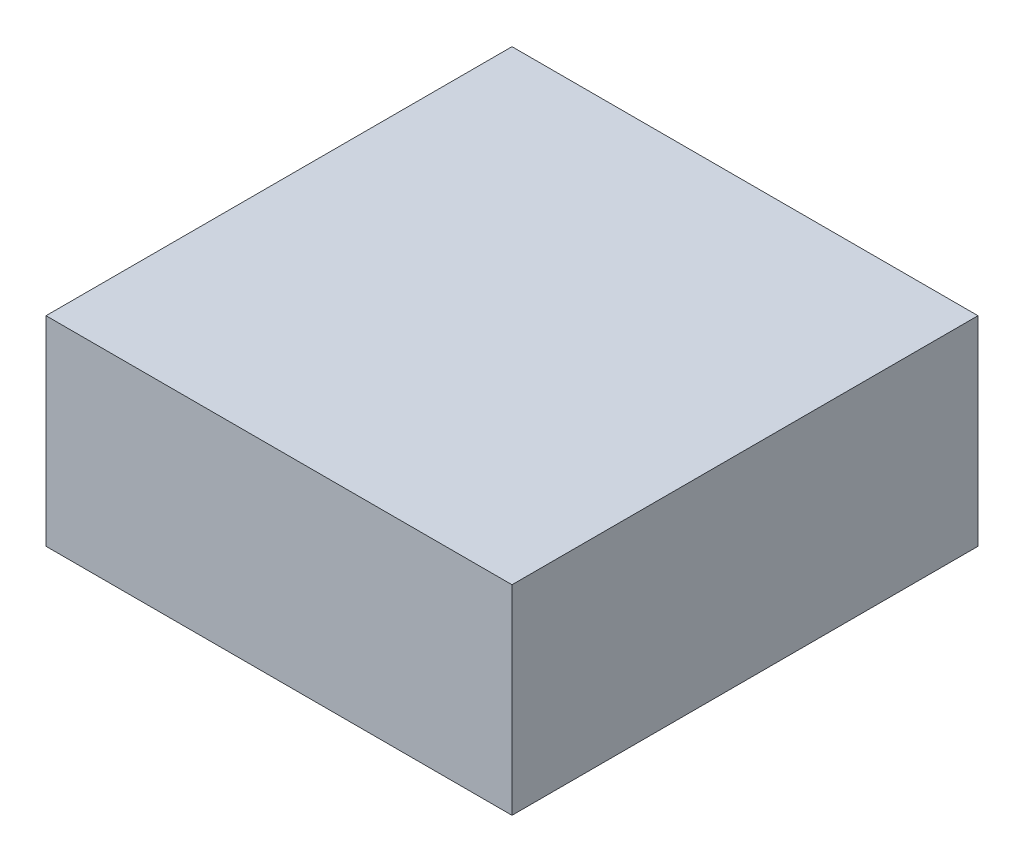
ISO-10303-21;
HEADER;
FILE_DESCRIPTION(('STEP AP214'),'2;1');
FILE_NAME('part.step','',(''),(''),'','','');
FILE_SCHEMA(('AUTOMOTIVE_DESIGN { 1 0 10303 214 1 1 1 1 }'));
ENDSEC;
DATA;
#1=APPLICATION_CONTEXT('core data for automotive mechanical design processes');
#2=APPLICATION_PROTOCOL_DEFINITION('international standard','automotive_design',2000,#1);
#3=PRODUCT_CONTEXT('',#1,'mechanical');
#4=PRODUCT('Part','Part','',(#3));
#5=PRODUCT_RELATED_PRODUCT_CATEGORY('part','',(#4));
#6=PRODUCT_DEFINITION_FORMATION('','',#4);
#7=PRODUCT_DEFINITION_CONTEXT('part definition',#1,'design');
#8=PRODUCT_DEFINITION('design','',#6,#7);
#9=PRODUCT_DEFINITION_SHAPE('','',#8);
#10=(LENGTH_UNIT() NAMED_UNIT(*) SI_UNIT(.MILLI.,.METRE.));
#11=(NAMED_UNIT(*) PLANE_ANGLE_UNIT() SI_UNIT($,.RADIAN.));
#12=(NAMED_UNIT(*) SI_UNIT($,.STERADIAN.) SOLID_ANGLE_UNIT());
#13=UNCERTAINTY_MEASURE_WITH_UNIT(LENGTH_MEASURE(1.E-05),#10,'distance_accuracy_value','');
#14=(GEOMETRIC_REPRESENTATION_CONTEXT(3) GLOBAL_UNCERTAINTY_ASSIGNED_CONTEXT((#13)) GLOBAL_UNIT_ASSIGNED_CONTEXT((#10,
#11,#12)) REPRESENTATION_CONTEXT('',''));
#15=CARTESIAN_POINT('',(0.,0.,0.));
#16=DIRECTION('',(0.,0.,1.));
#17=DIRECTION('',(1.,0.,0.));
#18=AXIS2_PLACEMENT_3D('',#15,#16,#17);
#19=CARTESIAN_POINT('',(17.5,15.,17.5));
#20=DIRECTION('',(-1.,0.,0.));
#21=DIRECTION('',(0.,0.,1.));
#22=AXIS2_PLACEMENT_3D('',#19,#20,#21);
#23=PLANE('',#22);
#24=DIRECTION('',(0.,0.,-1.));
#25=VECTOR('',#24,1.);
#26=CARTESIAN_POINT('',(17.5,0.,17.5));
#27=LINE('',#26,#25);
#28=CARTESIAN_POINT('',(17.5,0.,17.5));
#29=VERTEX_POINT('',#28);
#30=CARTESIAN_POINT('',(17.5,0.,-17.5));
#31=VERTEX_POINT('',#30);
#32=EDGE_CURVE('E575',#29,#31,#27,.T.);
#33=ORIENTED_EDGE('',*,*,#32,.T.);
#34=DIRECTION('',(0.,-1.,0.));
#35=VECTOR('',#34,1.);
#36=CARTESIAN_POINT('',(17.5,15.,-17.5));
#37=LINE('',#36,#35);
#38=CARTESIAN_POINT('',(17.5,15.,-17.5));
#39=VERTEX_POINT('',#38);
#40=EDGE_CURVE('E635',#39,#31,#37,.T.);
#41=ORIENTED_EDGE('',*,*,#40,.F.);
#42=DIRECTION('',(0.,0.,-1.));
#43=VECTOR('',#42,1.);
#44=CARTESIAN_POINT('',(17.5,15.,17.5));
#45=LINE('',#44,#43);
#46=CARTESIAN_POINT('',(17.5,15.,17.5));
#47=VERTEX_POINT('',#46);
#48=EDGE_CURVE('E577',#47,#39,#45,.T.);
#49=ORIENTED_EDGE('',*,*,#48,.F.);
#50=DIRECTION('',(0.,-1.,0.));
#51=VECTOR('',#50,1.);
#52=CARTESIAN_POINT('',(17.5,15.,17.5));
#53=LINE('',#52,#51);
#54=EDGE_CURVE('E565',#47,#29,#53,.T.);
#55=ORIENTED_EDGE('',*,*,#54,.T.);
#56=EDGE_LOOP('',(#33,#41,#49,#55));
#57=FACE_BOUND('',#56,.T.);
#58=ADVANCED_FACE('F36',(#57),#23,.F.);
#59=CARTESIAN_POINT('',(-17.5,15.,-17.5));
#60=DIRECTION('',(0.,0.,1.));
#61=DIRECTION('',(1.,0.,0.));
#62=AXIS2_PLACEMENT_3D('',#59,#60,#61);
#63=PLANE('',#62);
#64=DIRECTION('',(-1.,0.,0.));
#65=VECTOR('',#64,1.);
#66=CARTESIAN_POINT('',(-17.5,0.,-17.5));
#67=LINE('',#66,#65);
#68=CARTESIAN_POINT('',(-17.5,0.,-17.5));
#69=VERTEX_POINT('',#68);
#70=EDGE_CURVE('E578',#31,#69,#67,.T.);
#71=ORIENTED_EDGE('',*,*,#70,.T.);
#72=DIRECTION('',(0.,-1.,0.));
#73=VECTOR('',#72,1.);
#74=CARTESIAN_POINT('',(-17.5,15.,-17.5));
#75=LINE('',#74,#73);
#76=CARTESIAN_POINT('',(-17.5,15.,-17.5));
#77=VERTEX_POINT('',#76);
#78=EDGE_CURVE('E572',#77,#69,#75,.T.);
#79=ORIENTED_EDGE('',*,*,#78,.F.);
#80=DIRECTION('',(-1.,0.,0.));
#81=VECTOR('',#80,1.);
#82=CARTESIAN_POINT('',(-17.5,15.,-17.5));
#83=LINE('',#82,#81);
#84=EDGE_CURVE('E588',#39,#77,#83,.T.);
#85=ORIENTED_EDGE('',*,*,#84,.F.);
#86=ORIENTED_EDGE('',*,*,#40,.T.);
#87=EDGE_LOOP('',(#71,#79,#85,#86));
#88=FACE_BOUND('',#87,.T.);
#89=ADVANCED_FACE('F236',(#88),#63,.F.);
#90=CARTESIAN_POINT('',(-17.5,15.,17.5));
#91=DIRECTION('',(1.,0.,0.));
#92=DIRECTION('',(0.,0.,-1.));
#93=AXIS2_PLACEMENT_3D('',#90,#91,#92);
#94=PLANE('',#93);
#95=DIRECTION('',(0.,0.,1.));
#96=VECTOR('',#95,1.);
#97=CARTESIAN_POINT('',(-17.5,0.,17.5));
#98=LINE('',#97,#96);
#99=CARTESIAN_POINT('',(-17.5,0.,17.5));
#100=VERTEX_POINT('',#99);
#101=EDGE_CURVE('E634',#69,#100,#98,.T.);
#102=ORIENTED_EDGE('',*,*,#101,.T.);
#103=DIRECTION('',(0.,-1.,0.));
#104=VECTOR('',#103,1.);
#105=CARTESIAN_POINT('',(-17.5,15.,17.5));
#106=LINE('',#105,#104);
#107=CARTESIAN_POINT('',(-17.5,15.,17.5));
#108=VERTEX_POINT('',#107);
#109=EDGE_CURVE('E568',#108,#100,#106,.T.);
#110=ORIENTED_EDGE('',*,*,#109,.F.);
#111=DIRECTION('',(0.,0.,1.));
#112=VECTOR('',#111,1.);
#113=CARTESIAN_POINT('',(-17.5,15.,17.5));
#114=LINE('',#113,#112);
#115=EDGE_CURVE('E586',#77,#108,#114,.T.);
#116=ORIENTED_EDGE('',*,*,#115,.F.);
#117=ORIENTED_EDGE('',*,*,#78,.T.);
#118=EDGE_LOOP('',(#102,#110,#116,#117));
#119=FACE_BOUND('',#118,.T.);
#120=ADVANCED_FACE('F242',(#119),#94,.F.);
#121=CARTESIAN_POINT('',(-17.5,15.,17.5));
#122=DIRECTION('',(0.,0.,-1.));
#123=DIRECTION('',(-1.,0.,0.));
#124=AXIS2_PLACEMENT_3D('',#121,#122,#123);
#125=PLANE('',#124);
#126=DIRECTION('',(1.,0.,0.));
#127=VECTOR('',#126,1.);
#128=CARTESIAN_POINT('',(-17.5,0.,17.5));
#129=LINE('',#128,#127);
#130=EDGE_CURVE('E562',#100,#29,#129,.T.);
#131=ORIENTED_EDGE('',*,*,#130,.T.);
#132=ORIENTED_EDGE('',*,*,#54,.F.);
#133=DIRECTION('',(1.,0.,0.));
#134=VECTOR('',#133,1.);
#135=CARTESIAN_POINT('',(-17.5,15.,17.5));
#136=LINE('',#135,#134);
#137=EDGE_CURVE('E426',#108,#47,#136,.T.);
#138=ORIENTED_EDGE('',*,*,#137,.F.);
#139=ORIENTED_EDGE('',*,*,#109,.T.);
#140=EDGE_LOOP('',(#131,#132,#138,#139));
#141=FACE_BOUND('',#140,.T.);
#142=ADVANCED_FACE('F249',(#141),#125,.F.);
#143=CARTESIAN_POINT('',(0.,15.,0.));
#144=DIRECTION('',(0.,-1.,0.));
#145=DIRECTION('',(0.,0.,-1.));
#146=AXIS2_PLACEMENT_3D('',#143,#144,#145);
#147=PLANE('',#146);
#148=ORIENTED_EDGE('',*,*,#48,.T.);
#149=ORIENTED_EDGE('',*,*,#84,.T.);
#150=ORIENTED_EDGE('',*,*,#115,.T.);
#151=ORIENTED_EDGE('',*,*,#137,.T.);
#152=EDGE_LOOP('',(#148,#149,#150,#151));
#153=FACE_BOUND('',#152,.T.);
#154=ADVANCED_FACE('F253',(#153),#147,.F.);
#155=CARTESIAN_POINT('',(0.,0.,0.));
#156=DIRECTION('',(0.,-1.,0.));
#157=DIRECTION('',(0.,0.,-1.));
#158=AXIS2_PLACEMENT_3D('',#155,#156,#157);
#159=PLANE('',#158);
#160=CARTESIAN_POINT('',(0.,0.,0.));
#161=DIRECTION('',(0.,-1.,0.));
#162=DIRECTION('',(0.,0.,-1.));
#163=AXIS2_PLACEMENT_3D('',#160,#161,#162);
#164=CIRCLE('',#163,14.875);
#165=CARTESIAN_POINT('',(0.,0.,-14.875));
#166=VERTEX_POINT('',#165);
#167=EDGE_CURVE('E11',#166,#166,#164,.T.);
#168=ORIENTED_EDGE('',*,*,#167,.F.);
#169=EDGE_LOOP('',(#168));
#170=FACE_BOUND('',#169,.T.);
#171=ORIENTED_EDGE('',*,*,#32,.F.);
#172=ORIENTED_EDGE('',*,*,#130,.F.);
#173=ORIENTED_EDGE('',*,*,#101,.F.);
#174=ORIENTED_EDGE('',*,*,#70,.F.);
#175=EDGE_LOOP('',(#171,#172,#173,#174));
#176=FACE_BOUND('',#175,.T.);
#177=ADVANCED_FACE('F38',(#170,#176),#159,.T.);
#178=CARTESIAN_POINT('',(-4.42989709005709,6.,-0.0404739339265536));
#179=DIRECTION('',(-0.865110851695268,0.342020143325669,-0.366886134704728));
#180=DIRECTION('',(-0.390432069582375,0.,0.92063173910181));
#181=AXIS2_PLACEMENT_3D('',#178,#179,#180);
#182=PLANE('',#181);
#183=DIRECTION('',(0.189535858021,0.900138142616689,0.39220846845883));
#184=VECTOR('',#183,1.);
#185=CARTESIAN_POINT('',(-4.61303963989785,5.89361219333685,0.292195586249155));
#186=LINE('',#185,#184);
#187=CARTESIAN_POINT('',(-4.38007521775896,7.,0.774271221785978));
#188=VERTEX_POINT('',#187);
#189=CARTESIAN_POINT('',(-4.44324414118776,6.7,0.643555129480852));
#190=VERTEX_POINT('',#189);
#191=EDGE_CURVE('E421',#188,#190,#186,.F.);
#192=ORIENTED_EDGE('',*,*,#191,.F.);
#193=DIRECTION('',(0.390432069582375,0.,-0.92063173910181));
#194=VECTOR('',#193,1.);
#195=CARTESIAN_POINT('',(-3.43408154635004,7.,-1.45636469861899));
#196=LINE('',#195,#194);
#197=CARTESIAN_POINT('',(-5.12216433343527,7.,2.52410389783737));
#198=VERTEX_POINT('',#197);
#199=EDGE_CURVE('E372',#188,#198,#196,.F.);
#200=ORIENTED_EDGE('',*,*,#199,.T.);
#201=DIRECTION('',(0.448030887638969,0.855779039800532,-0.25867075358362));
#202=VECTOR('',#201,1.);
#203=CARTESIAN_POINT('',(-5.06940450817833,7.10077598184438,2.49364299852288));
#204=LINE('',#203,#202);
#205=CARTESIAN_POINT('',(-5.27922504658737,6.7,2.61478294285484));
#206=VERTEX_POINT('',#205);
#207=EDGE_CURVE('E386',#206,#198,#204,.T.);
#208=ORIENTED_EDGE('',*,*,#207,.F.);
#209=DIRECTION('',(0.390432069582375,0.,-0.92063173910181));
#210=VECTOR('',#209,1.);
#211=CARTESIAN_POINT('',(-4.19533930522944,6.7,0.0590000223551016));
#212=LINE('',#211,#210);
#213=EDGE_CURVE('E432',#190,#206,#212,.F.);
#214=ORIENTED_EDGE('',*,*,#213,.F.);
#215=EDGE_LOOP('',(#192,#200,#208,#214));
#216=FACE_BOUND('',#215,.T.);
#217=ADVANCED_FACE('F347',(#216),#182,.F.);
#218=CARTESIAN_POINT('',(-5.88897274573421,6.,3.39999999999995));
#219=DIRECTION('',(-0.114822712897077,0.342020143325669,0.932651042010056));
#220=DIRECTION('',(0.,-0.938860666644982,0.344297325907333));
#221=AXIS2_PLACEMENT_3D('',#218,#219,#220);
#222=PLANE('',#221);
#223=DIRECTION('',(0.448030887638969,0.855779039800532,-0.25867075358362));
#224=VECTOR('',#223,1.);
#225=CARTESIAN_POINT('',(-5.38586822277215,5.77974329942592,3.54271152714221));
#226=LINE('',#225,#224);
#227=CARTESIAN_POINT('',(-4.74702026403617,7.,3.17387248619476));
#228=VERTEX_POINT('',#227);
#229=CARTESIAN_POINT('',(-4.90408097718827,6.7,3.26455153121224));
#230=VERTEX_POINT('',#229);
#231=EDGE_CURVE('E376',#228,#230,#226,.F.);
#232=ORIENTED_EDGE('',*,*,#231,.F.);
#233=DIRECTION('',(-0.9925065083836,0.,-0.122191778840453));
#234=VECTOR('',#233,1.);
#235=CARTESIAN_POINT('',(-0.455791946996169,7.,3.70218420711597));
#236=LINE('',#235,#234);
#237=CARTESIAN_POINT('',(-2.86057615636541,7.,3.40612079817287));
#238=VERTEX_POINT('',#237);
#239=EDGE_CURVE('E365',#228,#238,#236,.F.);
#240=ORIENTED_EDGE('',*,*,#239,.T.);
#241=DIRECTION('',(-0.244894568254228,0.900138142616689,-0.360247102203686));
#242=VECTOR('',#241,1.);
#243=CARTESIAN_POINT('',(-2.82230029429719,6.85931266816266,3.46242571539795));
#244=LINE('',#243,#242);
#245=CARTESIAN_POINT('',(-2.77895716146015,6.7,3.52618473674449));
#246=VERTEX_POINT('',#245);
#247=EDGE_CURVE('E390',#246,#238,#244,.T.);
#248=ORIENTED_EDGE('',*,*,#247,.F.);
#249=DIRECTION('',(-0.9925065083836,0.,-0.122191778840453));
#250=VECTOR('',#249,1.);
#251=CARTESIAN_POINT('',(-5.85784082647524,6.7,3.14713002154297));
#252=LINE('',#251,#250);
#253=EDGE_CURVE('E379',#230,#246,#252,.F.);
#254=ORIENTED_EDGE('',*,*,#253,.F.);
#255=EDGE_LOOP('',(#232,#240,#248,#254));
#256=FACE_BOUND('',#255,.T.);
#257=ADVANCED_FACE('F308',(#256),#222,.F.);
#258=CARTESIAN_POINT('',(-5.32845686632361,5.60873322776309,3.07638600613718));
#259=DIRECTION('',(-0.448030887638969,-0.855779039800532,0.25867075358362));
#260=DIRECTION('',(0.885931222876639,-0.463816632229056,0.));
#261=AXIS2_PLACEMENT_3D('',#258,#259,#260);
#262=CYLINDRICAL_SURFACE('',#261,0.5);
#263=CARTESIAN_POINT('',(-4.75713974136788,6.7,2.74653591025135));
#264=DIRECTION('',(0.,1.,0.));
#265=DIRECTION('',(-0.866025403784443,0.,0.499999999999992));
#266=AXIS2_PLACEMENT_3D('',#263,#264,#265);
#267=ELLIPSE('',#266,0.584262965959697,0.5);
#268=EDGE_CURVE('E371',#230,#206,#267,.F.);
#269=ORIENTED_EDGE('',*,*,#268,.T.);
#270=ORIENTED_EDGE('',*,*,#207,.T.);
#271=CARTESIAN_POINT('',(-4.60007902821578,7.,2.65585686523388));
#272=DIRECTION('',(0.,-1.,0.));
#273=DIRECTION('',(-0.866025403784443,0.,0.499999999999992));
#274=AXIS2_PLACEMENT_3D('',#271,#272,#273);
#275=ELLIPSE('',#274,0.584262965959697,0.5);
#276=EDGE_CURVE('E368',#198,#228,#275,.F.);
#277=ORIENTED_EDGE('',*,*,#276,.T.);
#278=ORIENTED_EDGE('',*,*,#231,.T.);
#279=EDGE_LOOP('',(#269,#270,#277,#278));
#280=FACE_BOUND('',#279,.T.);
#281=ADVANCED_FACE('F304',(#280),#262,.F.);
#282=CARTESIAN_POINT('',(-2.17989709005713,6.,3.85664038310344));
#283=DIRECTION('',(0.909489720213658,0.342020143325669,0.236327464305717));
#284=DIRECTION('',(-0.351990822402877,0.936003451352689,0.));
#285=AXIS2_PLACEMENT_3D('',#282,#283,#284);
#286=PLANE('',#285);
#287=DIRECTION('',(-0.244894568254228,0.900138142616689,-0.360247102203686));
#288=VECTOR('',#287,1.);
#289=CARTESIAN_POINT('',(-2.04741240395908,5.89361219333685,3.50074993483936));
#290=LINE('',#289,#288);
#291=CARTESIAN_POINT('',(-2.34841993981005,7.,3.0579590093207));
#292=VERTEX_POINT('',#291);
#293=CARTESIAN_POINT('',(-2.26680094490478,6.7,3.17802294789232));
#294=VERTEX_POINT('',#293);
#295=EDGE_CURVE('E391',#292,#294,#290,.F.);
#296=ORIENTED_EDGE('',*,*,#295,.F.);
#297=DIRECTION('',(-0.251494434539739,0.,0.967858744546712));
#298=VECTOR('',#297,1.);
#299=CARTESIAN_POINT('',(-1.45554254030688,7.,-0.378217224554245));
#300=LINE('',#299,#298);
#301=CARTESIAN_POINT('',(-1.94445935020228,7.,1.50334492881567));
#302=VERTEX_POINT('',#301);
#303=EDGE_CURVE('E381',#292,#302,#300,.F.);
#304=ORIENTED_EDGE('',*,*,#303,.T.);
#305=DIRECTION('',(-0.393994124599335,0.890519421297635,0.227472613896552));
#306=VECTOR('',#305,1.);
#307=CARTESIAN_POINT('',(-1.84105635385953,6.7662848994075,1.44364518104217));
#308=LINE('',#307,#306);
#309=CARTESIAN_POINT('',(-1.81172980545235,6.7,1.42671349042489));
#310=VERTEX_POINT('',#309);
#311=EDGE_CURVE('E395',#310,#302,#308,.T.);
#312=ORIENTED_EDGE('',*,*,#311,.F.);
#313=DIRECTION('',(-0.251494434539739,0.,0.967858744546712));
#314=VECTOR('',#313,1.);
#315=CARTESIAN_POINT('',(-2.42648733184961,6.7,3.79256484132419));
#316=LINE('',#315,#314);
#317=EDGE_CURVE('E439',#294,#310,#316,.F.);
#318=ORIENTED_EDGE('',*,*,#317,.F.);
#319=EDGE_LOOP('',(#296,#304,#312,#318));
#320=FACE_BOUND('',#319,.T.);
#321=ADVANCED_FACE('F307',(#320),#286,.F.);
#322=CARTESIAN_POINT('',(-2.50215726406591,5.72260212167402,3.3825862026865));
#323=DIRECTION('',(0.244894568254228,-0.900138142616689,0.360247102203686));
#324=DIRECTION('',(0.,-0.37156124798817,-0.928408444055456));
#325=AXIS2_PLACEMENT_3D('',#322,#323,#324);
#326=CYLINDRICAL_SURFACE('',#325,0.5);
#327=CARTESIAN_POINT('',(-2.7680713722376,6.7,2.99141873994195));
#328=DIRECTION('',(0.,1.,0.));
#329=DIRECTION('',(0.562194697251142,0.,0.827004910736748));
#330=AXIS2_PLACEMENT_3D('',#327,#328,#329);
#331=ELLIPSE('',#330,0.555470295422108,0.5);
#332=EDGE_CURVE('E384',#294,#246,#331,.F.);
#333=ORIENTED_EDGE('',*,*,#332,.T.);
#334=ORIENTED_EDGE('',*,*,#247,.T.);
#335=CARTESIAN_POINT('',(-2.84969036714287,7.,2.87135480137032));
#336=DIRECTION('',(0.,-1.,0.));
#337=DIRECTION('',(0.562194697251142,0.,0.827004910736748));
#338=AXIS2_PLACEMENT_3D('',#335,#336,#337);
#339=ELLIPSE('',#338,0.555470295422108,0.5);
#340=EDGE_CURVE('E370',#238,#292,#339,.F.);
#341=ORIENTED_EDGE('',*,*,#340,.T.);
#342=ORIENTED_EDGE('',*,*,#295,.T.);
#343=EDGE_LOOP('',(#333,#334,#341,#342));
#344=FACE_BOUND('',#343,.T.);
#345=ADVANCED_FACE('F310',(#344),#326,.F.);
#346=CARTESIAN_POINT('',(-1.38564064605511,6.,0.799999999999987));
#347=DIRECTION('',(0.250079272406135,0.342020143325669,-0.905804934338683));
#348=DIRECTION('',(0.,0.935531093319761,0.353244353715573));
#349=AXIS2_PLACEMENT_3D('',#346,#347,#348);
#350=PLANE('',#349);
#351=DIRECTION('',(-0.393994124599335,0.890519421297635,0.227472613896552));
#352=VECTOR('',#351,1.);
#353=CARTESIAN_POINT('',(-1.77352316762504,5.86843262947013,0.643233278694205));
#354=LINE('',#353,#352);
#355=CARTESIAN_POINT('',(-2.27416457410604,7.,0.932278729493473));
#356=VERTEX_POINT('',#355);
#357=CARTESIAN_POINT('',(-2.14143502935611,6.7,0.85564729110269));
#358=VERTEX_POINT('',#357);
#359=EDGE_CURVE('E431',#356,#358,#354,.F.);
#360=ORIENTED_EDGE('',*,*,#359,.F.);
#361=DIRECTION('',(0.96393747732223,0.,0.266128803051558));
#362=VECTOR('',#361,1.);
#363=CARTESIAN_POINT('',(-0.400225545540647,7.,1.44964542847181));
#364=LINE('',#363,#362);
#365=CARTESIAN_POINT('',(-3.82248015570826,7.,0.504811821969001));
#366=VERTEX_POINT('',#365);
#367=EDGE_CURVE('E394',#356,#366,#364,.F.);
#368=ORIENTED_EDGE('',*,*,#367,.T.);
#369=DIRECTION('',(0.189535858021,0.900138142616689,0.39220846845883));
#370=VECTOR('',#369,1.);
#371=CARTESIAN_POINT('',(-3.88360440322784,6.70971051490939,0.378326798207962));
#372=LINE('',#371,#370);
#373=CARTESIAN_POINT('',(-3.88564907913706,6.7,0.374095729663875));
#374=VERTEX_POINT('',#373);
#375=EDGE_CURVE('E430',#374,#366,#372,.T.);
#376=ORIENTED_EDGE('',*,*,#375,.F.);
#377=DIRECTION('',(0.96393747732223,0.,0.266128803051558));
#378=VECTOR('',#377,1.);
#379=CARTESIAN_POINT('',(-1.45344472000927,6.7,1.04559118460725));
#380=LINE('',#379,#378);
#381=EDGE_CURVE('E436',#358,#374,#380,.F.);
#382=ORIENTED_EDGE('',*,*,#381,.F.);
#383=EDGE_LOOP('',(#360,#368,#376,#382));
#384=FACE_BOUND('',#383,.T.);
#385=ADVANCED_FACE('F302',(#384),#350,.F.);
#386=CARTESIAN_POINT('',(-1.89856280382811,5.6974225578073,1.09613574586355));
#387=DIRECTION('',(0.393994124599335,-0.890519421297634,-0.227472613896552));
#388=DIRECTION('',(0.914493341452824,0.404600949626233,0.));
#389=AXIS2_PLACEMENT_3D('',#386,#387,#388);
#390=CYLINDRICAL_SURFACE('',#389,0.5);
#391=CARTESIAN_POINT('',(-2.34213496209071,6.7,1.35223225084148));
#392=DIRECTION('',(0.,1.,0.));
#393=DIRECTION('',(0.866025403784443,0.,-0.499999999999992));
#394=AXIS2_PLACEMENT_3D('',#391,#392,#393);
#395=ELLIPSE('',#394,0.561470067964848,0.5);
#396=EDGE_CURVE('E398',#358,#310,#395,.F.);
#397=ORIENTED_EDGE('',*,*,#396,.T.);
#398=ORIENTED_EDGE('',*,*,#311,.T.);
#399=CARTESIAN_POINT('',(-2.47486450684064,7.,1.42886368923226));
#400=DIRECTION('',(0.,-1.,0.));
#401=DIRECTION('',(0.866025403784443,0.,-0.499999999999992));
#402=AXIS2_PLACEMENT_3D('',#399,#400,#401);
#403=ELLIPSE('',#402,0.561470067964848,0.5);
#404=EDGE_CURVE('E397',#302,#356,#403,.F.);
#405=ORIENTED_EDGE('',*,*,#404,.T.);
#406=ORIENTED_EDGE('',*,*,#359,.T.);
#407=EDGE_LOOP('',(#397,#398,#405,#406));
#408=FACE_BOUND('',#407,.T.);
#409=ADVANCED_FACE('F298',(#408),#390,.F.);
#410=CARTESIAN_POINT('',(-4.18048421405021,5.72260212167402,0.47563865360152));
#411=DIRECTION('',(-0.189535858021,-0.900138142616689,-0.39220846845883));
#412=DIRECTION('',(0.,0.399448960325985,-0.916755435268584));
#413=AXIS2_PLACEMENT_3D('',#410,#411,#412);
#414=CYLINDRICAL_SURFACE('',#413,0.5);
#415=CARTESIAN_POINT('',(-3.97468030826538,6.7,0.901510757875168));
#416=DIRECTION('',(0.,1.,0.));
#417=DIRECTION('',(-0.435109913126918,0.,-0.900377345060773));
#418=AXIS2_PLACEMENT_3D('',#415,#416,#417);
#419=ELLIPSE('',#418,0.555470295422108,0.5);
#420=EDGE_CURVE('E427',#190,#374,#419,.F.);
#421=ORIENTED_EDGE('',*,*,#420,.T.);
#422=ORIENTED_EDGE('',*,*,#375,.T.);
#423=CARTESIAN_POINT('',(-3.91151138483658,7.,1.03222685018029));
#424=DIRECTION('',(0.,-1.,0.));
#425=DIRECTION('',(-0.435109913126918,0.,-0.900377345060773));
#426=AXIS2_PLACEMENT_3D('',#423,#424,#425);
#427=ELLIPSE('',#426,0.555470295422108,0.5);
#428=EDGE_CURVE('E481',#366,#188,#427,.F.);
#429=ORIENTED_EDGE('',*,*,#428,.T.);
#430=ORIENTED_EDGE('',*,*,#191,.T.);
#431=EDGE_LOOP('',(#421,#422,#429,#430));
#432=FACE_BOUND('',#431,.T.);
#433=ADVANCED_FACE('F294',(#432),#414,.F.);
#434=CARTESIAN_POINT('',(0.,7.,0.));
#435=DIRECTION('',(0.,-1.,0.));
#436=DIRECTION('',(-0.866025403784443,0.,0.499999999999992));
#437=AXIS2_PLACEMENT_3D('',#434,#435,#436);
#438=PLANE('',#437);
#439=ORIENTED_EDGE('',*,*,#239,.F.);
#440=ORIENTED_EDGE('',*,*,#276,.F.);
#441=ORIENTED_EDGE('',*,*,#199,.F.);
#442=ORIENTED_EDGE('',*,*,#428,.F.);
#443=ORIENTED_EDGE('',*,*,#367,.F.);
#444=ORIENTED_EDGE('',*,*,#404,.F.);
#445=ORIENTED_EDGE('',*,*,#303,.F.);
#446=ORIENTED_EDGE('',*,*,#340,.F.);
#447=EDGE_LOOP('',(#439,#440,#441,#442,#443,#444,#445,#446));
#448=FACE_BOUND('',#447,.T.);
#449=ADVANCED_FACE('F297',(#448),#438,.T.);
#450=CARTESIAN_POINT('',(2.17989709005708,6.,3.85664038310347));
#451=DIRECTION('',(0.114822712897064,0.342020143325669,0.932651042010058));
#452=DIRECTION('',(0.,-0.938860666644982,0.344297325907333));
#453=AXIS2_PLACEMENT_3D('',#450,#451,#452);
#454=PLANE('',#453);
#455=DIRECTION('',(0.244894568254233,0.900138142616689,-0.360247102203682));
#456=VECTOR('',#455,1.);
#457=CARTESIAN_POINT('',(2.5595686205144,5.89361219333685,3.84891172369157));
#458=LINE('',#457,#456);
#459=CARTESIAN_POINT('',(2.86057615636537,7.,3.40612079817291));
#460=VERTEX_POINT('',#459);
#461=CARTESIAN_POINT('',(2.7789571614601,6.7,3.52618473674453));
#462=VERTEX_POINT('',#461);
#463=EDGE_CURVE('E412',#460,#462,#458,.F.);
#464=ORIENTED_EDGE('',*,*,#463,.F.);
#465=DIRECTION('',(-0.992506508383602,0.,0.122191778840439));
#466=VECTOR('',#465,1.);
#467=CARTESIAN_POINT('',(0.455791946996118,7.,3.70218420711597));
#468=LINE('',#467,#466);
#469=CARTESIAN_POINT('',(4.74702026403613,7.,3.17387248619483));
#470=VERTEX_POINT('',#469);
#471=EDGE_CURVE('E418',#460,#470,#468,.F.);
#472=ORIENTED_EDGE('',*,*,#471,.T.);
#473=DIRECTION('',(-0.448030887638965,0.855779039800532,-0.258670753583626));
#474=VECTOR('',#473,1.);
#475=CARTESIAN_POINT('',(4.6942604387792,7.10077598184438,3.14341158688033));
#476=LINE('',#475,#474);
#477=CARTESIAN_POINT('',(4.90408097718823,6.7,3.2645515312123));
#478=VERTEX_POINT('',#477);
#479=EDGE_CURVE('E459',#478,#470,#476,.T.);
#480=ORIENTED_EDGE('',*,*,#479,.F.);
#481=DIRECTION('',(-0.992506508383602,0.,0.122191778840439));
#482=VECTOR('',#481,1.);
#483=CARTESIAN_POINT('',(2.14876517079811,6.7,3.60377040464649));
#484=LINE('',#483,#482);
#485=EDGE_CURVE('E182',#462,#478,#484,.F.);
#486=ORIENTED_EDGE('',*,*,#485,.F.);
#487=EDGE_LOOP('',(#464,#472,#480,#486));
#488=FACE_BOUND('',#487,.T.);
#489=ADVANCED_FACE('F332',(#488),#454,.F.);
#490=CARTESIAN_POINT('',(5.88897274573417,6.,3.40000000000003));
#491=DIRECTION('',(0.865110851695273,0.342020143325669,-0.366886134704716));
#492=DIRECTION('',(-0.390432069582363,0.,-0.920631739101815));
#493=AXIS2_PLACEMENT_3D('',#490,#491,#492);
#494=PLANE('',#493);
#495=DIRECTION('',(-0.448030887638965,0.855779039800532,-0.258670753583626));
#496=VECTOR('',#495,1.);
#497=CARTESIAN_POINT('',(5.76101229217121,5.77974329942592,2.8929429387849));
#498=LINE('',#497,#496);
#499=CARTESIAN_POINT('',(5.12216433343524,7.,2.52410389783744));
#500=VERTEX_POINT('',#499);
#501=CARTESIAN_POINT('',(5.27922504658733,6.7,2.61478294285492));
#502=VERTEX_POINT('',#501);
#503=EDGE_CURVE('E191',#500,#502,#498,.F.);
#504=ORIENTED_EDGE('',*,*,#503,.F.);
#505=DIRECTION('',(0.390432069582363,0.,0.920631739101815));
#506=VECTOR('',#505,1.);
#507=CARTESIAN_POINT('',(3.43408154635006,7.,-1.45636469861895));
#508=LINE('',#507,#506);
#509=CARTESIAN_POINT('',(4.38007521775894,7.,0.77427122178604));
#510=VERTEX_POINT('',#509);
#511=EDGE_CURVE('E163',#500,#510,#508,.F.);
#512=ORIENTED_EDGE('',*,*,#511,.T.);
#513=DIRECTION('',(-0.189535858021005,0.900138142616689,0.392208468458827));
#514=VECTOR('',#513,1.);
#515=CARTESIAN_POINT('',(4.40969877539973,6.85931266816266,0.712970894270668));
#516=LINE('',#515,#514);
#517=CARTESIAN_POINT('',(4.44324414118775,6.7,0.643555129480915));
#518=VERTEX_POINT('',#517);
#519=EDGE_CURVE('E156',#518,#510,#516,.T.);
#520=ORIENTED_EDGE('',*,*,#519,.F.);
#521=DIRECTION('',(0.390432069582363,0.,0.920631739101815));
#522=VECTOR('',#521,1.);
#523=CARTESIAN_POINT('',(5.65441496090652,6.7,3.49947395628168));
#524=LINE('',#523,#522);
#525=EDGE_CURVE('E161',#502,#518,#524,.F.);
#526=ORIENTED_EDGE('',*,*,#525,.F.);
#527=EDGE_LOOP('',(#504,#512,#520,#526));
#528=FACE_BOUND('',#527,.T.);
#529=ADVANCED_FACE('F159',(#528),#494,.F.);
#530=CARTESIAN_POINT('',(5.32845686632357,5.60873322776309,3.07638600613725));
#531=DIRECTION('',(0.448030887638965,-0.855779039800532,0.258670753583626));
#532=DIRECTION('',(0.88593122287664,0.463816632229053,0.));
#533=AXIS2_PLACEMENT_3D('',#530,#531,#532);
#534=CYLINDRICAL_SURFACE('',#533,0.5);
#535=CARTESIAN_POINT('',(4.75713974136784,6.7,2.74653591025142));
#536=DIRECTION('',(0.,1.,0.));
#537=DIRECTION('',(0.866025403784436,0.,0.500000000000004));
#538=AXIS2_PLACEMENT_3D('',#535,#536,#537);
#539=ELLIPSE('',#538,0.584262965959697,0.5);
#540=EDGE_CURVE('E179',#502,#478,#539,.F.);
#541=ORIENTED_EDGE('',*,*,#540,.T.);
#542=ORIENTED_EDGE('',*,*,#479,.T.);
#543=CARTESIAN_POINT('',(4.60007902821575,7.,2.65585686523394));
#544=DIRECTION('',(0.,-1.,0.));
#545=DIRECTION('',(0.866025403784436,0.,0.500000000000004));
#546=AXIS2_PLACEMENT_3D('',#543,#544,#545);
#547=ELLIPSE('',#546,0.584262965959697,0.5);
#548=EDGE_CURVE('E461',#470,#500,#547,.F.);
#549=ORIENTED_EDGE('',*,*,#548,.T.);
#550=ORIENTED_EDGE('',*,*,#503,.T.);
#551=EDGE_LOOP('',(#541,#542,#549,#550));
#552=FACE_BOUND('',#551,.T.);
#553=ADVANCED_FACE('F287',(#552),#534,.F.);
#554=CARTESIAN_POINT('',(4.4298970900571,6.,-0.0404739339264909));
#555=DIRECTION('',(-0.250079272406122,0.342020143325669,-0.905804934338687));
#556=DIRECTION('',(0.,0.935531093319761,0.353244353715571));
#557=AXIS2_PLACEMENT_3D('',#554,#555,#556);
#558=PLANE('',#557);
#559=DIRECTION('',(-0.189535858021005,0.900138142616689,0.392208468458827));
#560=VECTOR('',#559,1.);
#561=CARTESIAN_POINT('',(4.05544457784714,5.89361219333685,0.0227361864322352));
#562=LINE('',#561,#560);
#563=CARTESIAN_POINT('',(3.82248015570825,7.,0.504811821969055));
#564=VERTEX_POINT('',#563);
#565=CARTESIAN_POINT('',(3.88564907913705,6.7,0.37409572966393));
#566=VERTEX_POINT('',#565);
#567=EDGE_CURVE('E186',#564,#566,#562,.F.);
#568=ORIENTED_EDGE('',*,*,#567,.F.);
#569=DIRECTION('',(0.963937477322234,0.,-0.266128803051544));
#570=VECTOR('',#569,1.);
#571=CARTESIAN_POINT('',(0.400225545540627,7.,1.44964542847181));
#572=LINE('',#571,#570);
#573=CARTESIAN_POINT('',(2.27416457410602,7.,0.932278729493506));
#574=VERTEX_POINT('',#573);
#575=EDGE_CURVE('E188',#564,#574,#572,.F.);
#576=ORIENTED_EDGE('',*,*,#575,.T.);
#577=DIRECTION('',(0.393994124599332,0.890519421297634,0.227472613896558));
#578=VECTOR('',#577,1.);
#579=CARTESIAN_POINT('',(2.17076157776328,6.7662848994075,0.872578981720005));
#580=LINE('',#579,#578);
#581=CARTESIAN_POINT('',(2.1414350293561,6.7,0.855647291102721));
#582=VERTEX_POINT('',#581);
#583=EDGE_CURVE('E458',#582,#574,#580,.T.);
#584=ORIENTED_EDGE('',*,*,#583,.F.);
#585=DIRECTION('',(0.963937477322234,0.,-0.266128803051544));
#586=VECTOR('',#585,1.);
#587=CARTESIAN_POINT('',(4.49770116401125,6.7,0.205117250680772));
#588=LINE('',#587,#586);
#589=EDGE_CURVE('E181',#566,#582,#588,.F.);
#590=ORIENTED_EDGE('',*,*,#589,.F.);
#591=EDGE_LOOP('',(#568,#576,#584,#590));
#592=FACE_BOUND('',#591,.T.);
#593=ADVANCED_FACE('F290',(#592),#558,.F.);
#594=CARTESIAN_POINT('',(4.18048421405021,5.72260212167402,0.475638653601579));
#595=DIRECTION('',(0.189535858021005,-0.900138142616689,-0.392208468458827));
#596=DIRECTION('',(0.,0.399448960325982,-0.916755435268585));
#597=AXIS2_PLACEMENT_3D('',#594,#595,#596);
#598=CYLINDRICAL_SURFACE('',#597,0.5);
#599=CARTESIAN_POINT('',(3.97468030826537,6.7,0.901510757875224));
#600=DIRECTION('',(0.,1.,0.));
#601=DIRECTION('',(0.435109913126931,0.,-0.900377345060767));
#602=AXIS2_PLACEMENT_3D('',#599,#600,#601);
#603=ELLIPSE('',#602,0.555470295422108,0.5);
#604=EDGE_CURVE('E168',#566,#518,#603,.F.);
#605=ORIENTED_EDGE('',*,*,#604,.T.);
#606=ORIENTED_EDGE('',*,*,#519,.T.);
#607=CARTESIAN_POINT('',(3.91151138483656,7.,1.03222685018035));
#608=DIRECTION('',(0.,-1.,0.));
#609=DIRECTION('',(0.435109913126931,0.,-0.900377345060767));
#610=AXIS2_PLACEMENT_3D('',#607,#608,#609);
#611=ELLIPSE('',#610,0.555470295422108,0.5);
#612=EDGE_CURVE('E167',#510,#564,#611,.F.);
#613=ORIENTED_EDGE('',*,*,#612,.T.);
#614=ORIENTED_EDGE('',*,*,#567,.T.);
#615=EDGE_LOOP('',(#605,#606,#613,#614));
#616=FACE_BOUND('',#615,.T.);
#617=ADVANCED_FACE('F184',(#616),#598,.F.);
#618=CARTESIAN_POINT('',(1.3856406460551,6.,0.800000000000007));
#619=DIRECTION('',(-0.909489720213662,0.342020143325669,0.236327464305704));
#620=DIRECTION('',(-0.351990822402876,-0.93600345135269,0.));
#621=AXIS2_PLACEMENT_3D('',#618,#619,#620);
#622=PLANE('',#621);
#623=DIRECTION('',(0.393994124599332,0.890519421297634,0.227472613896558));
#624=VECTOR('',#623,1.);
#625=CARTESIAN_POINT('',(1.44381794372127,5.86843262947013,1.21429947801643));
#626=LINE('',#625,#624);
#627=CARTESIAN_POINT('',(1.94445935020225,7.,1.5033449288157));
#628=VERTEX_POINT('',#627);
#629=CARTESIAN_POINT('',(1.81172980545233,6.7,1.42671349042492));
#630=VERTEX_POINT('',#629);
#631=EDGE_CURVE('E452',#628,#630,#626,.F.);
#632=ORIENTED_EDGE('',*,*,#631,.F.);
#633=DIRECTION('',(-0.251494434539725,0.,-0.967858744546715));
#634=VECTOR('',#633,1.);
#635=CARTESIAN_POINT('',(1.45554254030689,7.,-0.378217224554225));
#636=LINE('',#635,#634);
#637=CARTESIAN_POINT('',(2.34841993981,7.,3.05795900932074));
#638=VERTEX_POINT('',#637);
#639=EDGE_CURVE('E413',#628,#638,#636,.F.);
#640=ORIENTED_EDGE('',*,*,#639,.T.);
#641=DIRECTION('',(0.244894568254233,0.900138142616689,-0.360247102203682));
#642=VECTOR('',#641,1.);
#643=CARTESIAN_POINT('',(2.26944281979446,6.70971051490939,3.17413667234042));
#644=LINE('',#643,#642);
#645=CARTESIAN_POINT('',(2.26680094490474,6.7,3.17802294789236));
#646=VERTEX_POINT('',#645);
#647=EDGE_CURVE('E451',#646,#638,#644,.T.);
#648=ORIENTED_EDGE('',*,*,#647,.F.);
#649=DIRECTION('',(-0.251494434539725,0.,-0.967858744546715));
#650=VECTOR('',#649,1.);
#651=CARTESIAN_POINT('',(1.63223088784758,6.7,0.735924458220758));
#652=LINE('',#651,#650);
#653=EDGE_CURVE('E201',#630,#646,#652,.F.);
#654=ORIENTED_EDGE('',*,*,#653,.F.);
#655=EDGE_LOOP('',(#632,#640,#648,#654));
#656=FACE_BOUND('',#655,.T.);
#657=ADVANCED_FACE('F285',(#656),#622,.F.);
#658=CARTESIAN_POINT('',(1.8985628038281,5.6974225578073,1.09613574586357));
#659=DIRECTION('',(-0.393994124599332,-0.890519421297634,-0.227472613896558));
#660=DIRECTION('',(0.914493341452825,-0.40460094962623,0.));
#661=AXIS2_PLACEMENT_3D('',#658,#659,#660);
#662=CYLINDRICAL_SURFACE('',#661,0.5);
#663=CARTESIAN_POINT('',(2.3421349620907,6.7,1.35223225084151));
#664=DIRECTION('',(0.,1.,0.));
#665=DIRECTION('',(-0.866025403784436,0.,-0.500000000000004));
#666=AXIS2_PLACEMENT_3D('',#663,#664,#665);
#667=ELLIPSE('',#666,0.561470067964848,0.5);
#668=EDGE_CURVE('E415',#630,#582,#667,.F.);
#669=ORIENTED_EDGE('',*,*,#668,.T.);
#670=ORIENTED_EDGE('',*,*,#583,.T.);
#671=CARTESIAN_POINT('',(2.47486450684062,7.,1.4288636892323));
#672=DIRECTION('',(0.,-1.,0.));
#673=DIRECTION('',(-0.866025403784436,0.,-0.500000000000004));
#674=AXIS2_PLACEMENT_3D('',#671,#672,#673);
#675=ELLIPSE('',#674,0.561470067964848,0.5);
#676=EDGE_CURVE('E470',#574,#628,#675,.F.);
#677=ORIENTED_EDGE('',*,*,#676,.T.);
#678=ORIENTED_EDGE('',*,*,#631,.T.);
#679=EDGE_LOOP('',(#669,#670,#677,#678));
#680=FACE_BOUND('',#679,.T.);
#681=ADVANCED_FACE('F281',(#680),#662,.F.);
#682=CARTESIAN_POINT('',(2.50215726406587,5.72260212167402,3.38258620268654));
#683=DIRECTION('',(-0.244894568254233,-0.900138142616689,0.360247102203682));
#684=DIRECTION('',(0.,-0.371561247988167,-0.928408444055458));
#685=AXIS2_PLACEMENT_3D('',#682,#683,#684);
#686=CYLINDRICAL_SURFACE('',#685,0.5);
#687=CARTESIAN_POINT('',(2.76807137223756,6.7,2.99141873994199));
#688=DIRECTION('',(0.,1.,0.));
#689=DIRECTION('',(-0.562194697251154,0.,0.827004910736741));
#690=AXIS2_PLACEMENT_3D('',#687,#688,#689);
#691=ELLIPSE('',#690,0.555470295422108,0.5);
#692=EDGE_CURVE('E448',#462,#646,#691,.F.);
#693=ORIENTED_EDGE('',*,*,#692,.T.);
#694=ORIENTED_EDGE('',*,*,#647,.T.);
#695=CARTESIAN_POINT('',(2.84969036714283,7.,2.87135480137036));
#696=DIRECTION('',(0.,-1.,0.));
#697=DIRECTION('',(-0.562194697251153,0.,0.82700491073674));
#698=AXIS2_PLACEMENT_3D('',#695,#696,#697);
#699=ELLIPSE('',#698,0.555470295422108,0.5);
#700=EDGE_CURVE('E472',#638,#460,#699,.F.);
#701=ORIENTED_EDGE('',*,*,#700,.T.);
#702=ORIENTED_EDGE('',*,*,#463,.T.);
#703=EDGE_LOOP('',(#693,#694,#701,#702));
#704=FACE_BOUND('',#703,.T.);
#705=ADVANCED_FACE('F277',(#704),#686,.F.);
#706=CARTESIAN_POINT('',(0.,7.,0.));
#707=DIRECTION('',(0.,-1.,0.));
#708=DIRECTION('',(0.866025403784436,0.,0.500000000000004));
#709=AXIS2_PLACEMENT_3D('',#706,#707,#708);
#710=PLANE('',#709);
#711=ORIENTED_EDGE('',*,*,#511,.F.);
#712=ORIENTED_EDGE('',*,*,#548,.F.);
#713=ORIENTED_EDGE('',*,*,#471,.F.);
#714=ORIENTED_EDGE('',*,*,#700,.F.);
#715=ORIENTED_EDGE('',*,*,#639,.F.);
#716=ORIENTED_EDGE('',*,*,#676,.F.);
#717=ORIENTED_EDGE('',*,*,#575,.F.);
#718=ORIENTED_EDGE('',*,*,#612,.F.);
#719=EDGE_LOOP('',(#711,#712,#713,#714,#715,#716,#717,#718));
#720=FACE_BOUND('',#719,.T.);
#721=ADVANCED_FACE('F280',(#720),#710,.T.);
#722=CARTESIAN_POINT('',(2.25,6.,-3.81616644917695));
#723=DIRECTION('',(0.750288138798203,0.342020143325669,-0.565764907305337));
#724=DIRECTION('',(-0.602074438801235,0.,-0.79843996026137));
#725=AXIS2_PLACEMENT_3D('',#722,#723,#724);
#726=PLANE('',#725);
#727=DIRECTION('',(-0.434430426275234,0.900138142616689,-0.0319613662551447));
#728=VECTOR('',#727,1.);
#729=CARTESIAN_POINT('',(2.05347101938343,5.89361219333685,-4.14110730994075));
#730=LINE('',#729,#728);
#731=CARTESIAN_POINT('',(1.51949906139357,7.,-4.18039201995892));
#732=VERTEX_POINT('',#731);
#733=CARTESIAN_POINT('',(1.66428697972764,6.7,-4.16973986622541));
#734=VERTEX_POINT('',#733);
#735=EDGE_CURVE('E435',#732,#734,#730,.F.);
#736=ORIENTED_EDGE('',*,*,#735,.F.);
#737=DIRECTION('',(0.602074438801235,0.,0.79843996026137));
#738=VECTOR('',#737,1.);
#739=CARTESIAN_POINT('',(2.97828959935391,7.,-2.24581950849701));
#740=LINE('',#739,#738);
#741=CARTESIAN_POINT('',(0.375144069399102,7.,-5.69797638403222));
#742=VERTEX_POINT('',#741);
#743=EDGE_CURVE('E409',#732,#742,#740,.F.);
#744=ORIENTED_EDGE('',*,*,#743,.T.);
#745=DIRECTION('',(0.,0.855779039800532,0.517341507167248));
#746=VECTOR('',#745,1.);
#747=CARTESIAN_POINT('',(0.375144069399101,7.10077598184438,-5.63705458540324));
#748=LINE('',#747,#746);
#749=CARTESIAN_POINT('',(0.375144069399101,6.7,-5.87933447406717));
#750=VERTEX_POINT('',#749);
#751=EDGE_CURVE('E213',#750,#742,#748,.T.);
#752=ORIENTED_EDGE('',*,*,#751,.F.);
#753=DIRECTION('',(0.602074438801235,0.,0.79843996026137));
#754=VECTOR('',#753,1.);
#755=CARTESIAN_POINT('',(2.04657413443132,6.7,-3.66277042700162));
#756=LINE('',#755,#754);
#757=EDGE_CURVE('E198',#734,#750,#756,.F.);
#758=ORIENTED_EDGE('',*,*,#757,.F.);
#759=EDGE_LOOP('',(#736,#744,#752,#758));
#760=FACE_BOUND('',#759,.T.);
#761=ADVANCED_FACE('F316',(#760),#726,.F.);
#762=CARTESIAN_POINT('',(0.,6.,-6.8));
#763=DIRECTION('',(-0.750288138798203,0.342020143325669,-0.565764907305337));
#764=DIRECTION('',(-0.602074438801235,0.,0.79843996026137));
#765=AXIS2_PLACEMENT_3D('',#762,#763,#764);
#766=PLANE('',#765);
#767=DIRECTION('',(0.,0.855779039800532,0.517341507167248));
#768=VECTOR('',#767,1.);
#769=CARTESIAN_POINT('',(-0.375144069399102,5.77974329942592,-6.43565446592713));
#770=LINE('',#769,#768);
#771=CARTESIAN_POINT('',(-0.375144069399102,7.,-5.69797638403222));
#772=VERTEX_POINT('',#771);
#773=CARTESIAN_POINT('',(-0.375144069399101,6.7,-5.87933447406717));
#774=VERTEX_POINT('',#773);
#775=EDGE_CURVE('E406',#772,#774,#770,.F.);
#776=ORIENTED_EDGE('',*,*,#775,.F.);
#777=DIRECTION('',(0.602074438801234,0.,-0.79843996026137));
#778=VECTOR('',#777,1.);
#779=CARTESIAN_POINT('',(-2.97828959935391,7.,-2.24581950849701));
#780=LINE('',#779,#778);
#781=CARTESIAN_POINT('',(-1.51949906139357,7.,-4.18039201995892));
#782=VERTEX_POINT('',#781);
#783=EDGE_CURVE('E214',#772,#782,#780,.F.);
#784=ORIENTED_EDGE('',*,*,#783,.T.);
#785=DIRECTION('',(0.434430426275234,0.900138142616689,-0.0319613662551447));
#786=VECTOR('',#785,1.);
#787=CARTESIAN_POINT('',(-1.58739848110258,6.85931266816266,-4.17539660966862));
#788=LINE('',#787,#786);
#789=CARTESIAN_POINT('',(-1.66428697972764,6.7,-4.16973986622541));
#790=VERTEX_POINT('',#789);
#791=EDGE_CURVE('E593',#790,#782,#788,.T.);
#792=ORIENTED_EDGE('',*,*,#791,.F.);
#793=DIRECTION('',(0.602074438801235,0.,-0.79843996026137));
#794=VECTOR('',#793,1.);
#795=CARTESIAN_POINT('',(0.20342586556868,6.7,-6.64660397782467));
#796=LINE('',#795,#794);
#797=EDGE_CURVE('E200',#774,#790,#796,.F.);
#798=ORIENTED_EDGE('',*,*,#797,.F.);
#799=EDGE_LOOP('',(#776,#784,#792,#798));
#800=FACE_BOUND('',#799,.T.);
#801=ADVANCED_FACE('F271',(#800),#766,.F.);
#802=CARTESIAN_POINT('',(0.,5.60873322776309,-6.15277201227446));
#803=DIRECTION('',(0.,-0.855779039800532,-0.517341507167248));
#804=DIRECTION('',(0.,0.517341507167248,-0.855779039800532));
#805=AXIS2_PLACEMENT_3D('',#802,#803,#804);
#806=CYLINDRICAL_SURFACE('',#805,0.5);
#807=CARTESIAN_POINT('',(0.,6.7,-5.49307182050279));
#808=DIRECTION('',(0.,1.,0.));
#809=DIRECTION('',(0.,0.,-1.));
#810=AXIS2_PLACEMENT_3D('',#807,#808,#809);
#811=ELLIPSE('',#810,0.584262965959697,0.5);
#812=EDGE_CURVE('E210',#774,#750,#811,.F.);
#813=ORIENTED_EDGE('',*,*,#812,.T.);
#814=ORIENTED_EDGE('',*,*,#751,.T.);
#815=CARTESIAN_POINT('',(0.,7.,-5.31171373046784));
#816=DIRECTION('',(0.,-1.,0.));
#817=DIRECTION('',(0.,0.,-1.));
#818=AXIS2_PLACEMENT_3D('',#815,#816,#817);
#819=ELLIPSE('',#818,0.584262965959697,0.5);
#820=EDGE_CURVE('E595',#742,#772,#819,.F.);
#821=ORIENTED_EDGE('',*,*,#820,.T.);
#822=ORIENTED_EDGE('',*,*,#775,.T.);
#823=EDGE_LOOP('',(#813,#814,#821,#822));
#824=FACE_BOUND('',#823,.T.);
#825=ADVANCED_FACE('F267',(#824),#806,.F.);
#826=CARTESIAN_POINT('',(-2.25,6.,-3.81616644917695));
#827=DIRECTION('',(-0.659410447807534,0.342020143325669,0.669477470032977));
#828=DIRECTION('',(0.712443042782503,0.,0.701729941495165));
#829=AXIS2_PLACEMENT_3D('',#826,#827,#828);
#830=PLANE('',#829);
#831=DIRECTION('',(0.434430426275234,0.900138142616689,-0.0319613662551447));
#832=VECTOR('',#831,1.);
#833=CARTESIAN_POINT('',(-2.00803217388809,5.89361219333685,-3.52348612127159));
#834=LINE('',#833,#832);
#835=CARTESIAN_POINT('',(-1.47406021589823,7.,-3.56277083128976));
#836=VERTEX_POINT('',#835);
#837=CARTESIAN_POINT('',(-1.6188481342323,6.7,-3.55211867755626));
#838=VERTEX_POINT('',#837);
#839=EDGE_CURVE('E401',#836,#838,#834,.F.);
#840=ORIENTED_EDGE('',*,*,#839,.F.);
#841=DIRECTION('',(-0.712443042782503,0.,-0.701729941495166));
#842=VECTOR('',#841,1.);
#843=CARTESIAN_POINT('',(1.05531699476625,7.,-1.07142820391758));
#844=LINE('',#843,#842);
#845=CARTESIAN_POINT('',(-0.329705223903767,7.,-2.43562365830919));
#846=VERTEX_POINT('',#845);
#847=EDGE_CURVE('E402',#836,#846,#844,.F.);
#848=ORIENTED_EDGE('',*,*,#847,.T.);
#849=DIRECTION('',(0.,0.890519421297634,-0.454945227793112));
#850=VECTOR('',#849,1.);
#851=CARTESIAN_POINT('',(-0.329705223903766,6.7662848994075,-2.31622416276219));
#852=LINE('',#851,#850);
#853=CARTESIAN_POINT('',(-0.329705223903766,6.7,-2.28236078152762));
#854=VERTEX_POINT('',#853);
#855=EDGE_CURVE('E208',#854,#846,#852,.T.);
#856=ORIENTED_EDGE('',*,*,#855,.F.);
#857=DIRECTION('',(-0.712443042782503,0.,-0.701729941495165));
#858=VECTOR('',#857,1.);
#859=CARTESIAN_POINT('',(-2.07121383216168,6.7,-3.99768209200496));
#860=LINE('',#859,#858);
#861=EDGE_CURVE('E204',#838,#854,#860,.F.);
#862=ORIENTED_EDGE('',*,*,#861,.F.);
#863=EDGE_LOOP('',(#840,#848,#856,#862));
#864=FACE_BOUND('',#863,.T.);
#865=ADVANCED_FACE('F270',(#864),#830,.F.);
#866=CARTESIAN_POINT('',(-1.67832694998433,5.72260212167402,-3.85822485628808));
#867=DIRECTION('',(-0.434430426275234,-0.900138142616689,0.0319613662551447));
#868=DIRECTION('',(0.900598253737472,-0.434652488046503,0.));
#869=AXIS2_PLACEMENT_3D('',#866,#867,#868);
#870=CYLINDRICAL_SURFACE('',#869,0.5);
#871=CARTESIAN_POINT('',(-1.20660893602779,6.7,-3.89292949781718));
#872=DIRECTION('',(0.,1.,0.));
#873=DIRECTION('',(-0.997304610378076,0.,0.0733724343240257));
#874=AXIS2_PLACEMENT_3D('',#871,#872,#873);
#875=ELLIPSE('',#874,0.555470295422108,0.5);
#876=EDGE_CURVE('E405',#838,#790,#875,.F.);
#877=ORIENTED_EDGE('',*,*,#876,.T.);
#878=ORIENTED_EDGE('',*,*,#791,.T.);
#879=CARTESIAN_POINT('',(-1.06182101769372,7.,-3.90358165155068));
#880=DIRECTION('',(0.,-1.,0.));
#881=DIRECTION('',(-0.997304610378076,0.,0.0733724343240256));
#882=AXIS2_PLACEMENT_3D('',#879,#880,#881);
#883=ELLIPSE('',#882,0.555470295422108,0.5);
#884=EDGE_CURVE('E602',#782,#836,#883,.F.);
#885=ORIENTED_EDGE('',*,*,#884,.T.);
#886=ORIENTED_EDGE('',*,*,#839,.T.);
#887=EDGE_LOOP('',(#877,#878,#885,#886));
#888=FACE_BOUND('',#887,.T.);
#889=ADVANCED_FACE('F273',(#888),#870,.F.);
#890=CARTESIAN_POINT('',(0.,6.,-1.6));
#891=DIRECTION('',(0.659410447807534,0.342020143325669,0.669477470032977));
#892=DIRECTION('',(0.712443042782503,0.,-0.701729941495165));
#893=AXIS2_PLACEMENT_3D('',#890,#891,#892);
#894=PLANE('',#893);
#895=DIRECTION('',(0.,0.890519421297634,-0.454945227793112));
#896=VECTOR('',#895,1.);
#897=CARTESIAN_POINT('',(0.329705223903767,5.86843262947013,-1.85753275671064));
#898=LINE('',#897,#896);
#899=CARTESIAN_POINT('',(0.329705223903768,7.,-2.43562365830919));
#900=VERTEX_POINT('',#899);
#901=CARTESIAN_POINT('',(0.329705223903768,6.7,-2.28236078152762));
#902=VERTEX_POINT('',#901);
#903=EDGE_CURVE('E197',#900,#902,#898,.F.);
#904=ORIENTED_EDGE('',*,*,#903,.F.);
#905=DIRECTION('',(-0.712443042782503,0.,0.701729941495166));
#906=VECTOR('',#905,1.);
#907=CARTESIAN_POINT('',(-1.05531699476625,7.,-1.07142820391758));
#908=LINE('',#907,#906);
#909=CARTESIAN_POINT('',(1.47406021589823,7.,-3.56277083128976));
#910=VERTEX_POINT('',#909);
#911=EDGE_CURVE('E209',#900,#910,#908,.F.);
#912=ORIENTED_EDGE('',*,*,#911,.T.);
#913=DIRECTION('',(-0.434430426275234,0.900138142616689,-0.0319613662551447));
#914=VECTOR('',#913,1.);
#915=CARTESIAN_POINT('',(1.61416158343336,6.70971051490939,-3.55246347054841));
#916=LINE('',#915,#914);
#917=CARTESIAN_POINT('',(1.6188481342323,6.7,-3.55211867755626));
#918=VERTEX_POINT('',#917);
#919=EDGE_CURVE('E196',#918,#910,#916,.T.);
#920=ORIENTED_EDGE('',*,*,#919,.F.);
#921=DIRECTION('',(-0.712443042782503,0.,0.701729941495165));
#922=VECTOR('',#921,1.);
#923=CARTESIAN_POINT('',(-0.178786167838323,6.7,-1.78151564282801));
#924=LINE('',#923,#922);
#925=EDGE_CURVE('E202',#902,#918,#924,.F.);
#926=ORIENTED_EDGE('',*,*,#925,.F.);
#927=EDGE_LOOP('',(#904,#912,#920,#926));
#928=FACE_BOUND('',#927,.T.);
#929=ADVANCED_FACE('F265',(#928),#894,.F.);
#930=CARTESIAN_POINT('',(0.,5.6974225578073,-2.19227149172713));
#931=DIRECTION('',(0.,-0.890519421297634,0.454945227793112));
#932=DIRECTION('',(0.,-0.454945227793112,-0.890519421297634));
#933=AXIS2_PLACEMENT_3D('',#930,#931,#932);
#934=CYLINDRICAL_SURFACE('',#933,0.5);
#935=CARTESIAN_POINT('',(0.,6.7,-2.704464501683));
#936=DIRECTION('',(0.,1.,0.));
#937=DIRECTION('',(0.,0.,1.));
#938=AXIS2_PLACEMENT_3D('',#935,#936,#937);
#939=ELLIPSE('',#938,0.561470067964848,0.5);
#940=EDGE_CURVE('E205',#902,#854,#939,.F.);
#941=ORIENTED_EDGE('',*,*,#940,.T.);
#942=ORIENTED_EDGE('',*,*,#855,.T.);
#943=CARTESIAN_POINT('',(0.,7.,-2.85772737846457));
#944=DIRECTION('',(0.,-1.,0.));
#945=DIRECTION('',(0.,0.,1.));
#946=AXIS2_PLACEMENT_3D('',#943,#944,#945);
#947=ELLIPSE('',#946,0.561470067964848,0.5);
#948=EDGE_CURVE('E600',#846,#900,#947,.F.);
#949=ORIENTED_EDGE('',*,*,#948,.T.);
#950=ORIENTED_EDGE('',*,*,#903,.T.);
#951=EDGE_LOOP('',(#941,#942,#949,#950));
#952=FACE_BOUND('',#951,.T.);
#953=ADVANCED_FACE('F261',(#952),#934,.F.);
#954=CARTESIAN_POINT('',(1.67832694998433,5.72260212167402,-3.85822485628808));
#955=DIRECTION('',(0.434430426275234,-0.900138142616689,0.0319613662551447));
#956=DIRECTION('',(0.900598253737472,0.434652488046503,0.));
#957=AXIS2_PLACEMENT_3D('',#954,#955,#956);
#958=CYLINDRICAL_SURFACE('',#957,0.5);
#959=CARTESIAN_POINT('',(1.2066089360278,6.7,-3.89292949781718));
#960=DIRECTION('',(0.,1.,0.));
#961=DIRECTION('',(0.997304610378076,0.,0.0733724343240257));
#962=AXIS2_PLACEMENT_3D('',#959,#960,#961);
#963=ELLIPSE('',#962,0.555470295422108,0.5);
#964=EDGE_CURVE('E55',#734,#918,#963,.F.);
#965=ORIENTED_EDGE('',*,*,#964,.T.);
#966=ORIENTED_EDGE('',*,*,#919,.T.);
#967=CARTESIAN_POINT('',(1.06182101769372,7.,-3.90358165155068));
#968=DIRECTION('',(0.,-1.,0.));
#969=DIRECTION('',(0.997304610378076,0.,0.0733724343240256));
#970=AXIS2_PLACEMENT_3D('',#967,#968,#969);
#971=ELLIPSE('',#970,0.555470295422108,0.5);
#972=EDGE_CURVE('E597',#910,#732,#971,.F.);
#973=ORIENTED_EDGE('',*,*,#972,.T.);
#974=ORIENTED_EDGE('',*,*,#735,.T.);
#975=EDGE_LOOP('',(#965,#966,#973,#974));
#976=FACE_BOUND('',#975,.T.);
#977=ADVANCED_FACE('F258',(#976),#958,.F.);
#978=CARTESIAN_POINT('',(0.,7.,0.));
#979=DIRECTION('',(0.,-1.,0.));
#980=DIRECTION('',(0.,0.,-1.));
#981=AXIS2_PLACEMENT_3D('',#978,#979,#980);
#982=PLANE('',#981);
#983=ORIENTED_EDGE('',*,*,#783,.F.);
#984=ORIENTED_EDGE('',*,*,#820,.F.);
#985=ORIENTED_EDGE('',*,*,#743,.F.);
#986=ORIENTED_EDGE('',*,*,#972,.F.);
#987=ORIENTED_EDGE('',*,*,#911,.F.);
#988=ORIENTED_EDGE('',*,*,#948,.F.);
#989=ORIENTED_EDGE('',*,*,#847,.F.);
#990=ORIENTED_EDGE('',*,*,#884,.F.);
#991=EDGE_LOOP('',(#983,#984,#985,#986,#987,#988,#989,#990));
#992=FACE_BOUND('',#991,.T.);
#993=ADVANCED_FACE('F233',(#992),#982,.T.);
#994=CARTESIAN_POINT('',(0.,6.7,-8.85));
#995=DIRECTION('',(0.,1.,0.));
#996=DIRECTION('',(0.,0.,1.));
#997=AXIS2_PLACEMENT_3D('',#994,#995,#996);
#998=PLANE('',#997);
#999=ORIENTED_EDGE('',*,*,#213,.T.);
#1000=ORIENTED_EDGE('',*,*,#268,.F.);
#1001=ORIENTED_EDGE('',*,*,#253,.T.);
#1002=ORIENTED_EDGE('',*,*,#332,.F.);
#1003=ORIENTED_EDGE('',*,*,#317,.T.);
#1004=ORIENTED_EDGE('',*,*,#396,.F.);
#1005=ORIENTED_EDGE('',*,*,#381,.T.);
#1006=ORIENTED_EDGE('',*,*,#420,.F.);
#1007=EDGE_LOOP('',(#999,#1000,#1001,#1002,#1003,#1004,#1005,#1006));
#1008=FACE_BOUND('',#1007,.T.);
#1009=ORIENTED_EDGE('',*,*,#485,.T.);
#1010=ORIENTED_EDGE('',*,*,#540,.F.);
#1011=ORIENTED_EDGE('',*,*,#525,.T.);
#1012=ORIENTED_EDGE('',*,*,#604,.F.);
#1013=ORIENTED_EDGE('',*,*,#589,.T.);
#1014=ORIENTED_EDGE('',*,*,#668,.F.);
#1015=ORIENTED_EDGE('',*,*,#653,.T.);
#1016=ORIENTED_EDGE('',*,*,#692,.F.);
#1017=EDGE_LOOP('',(#1009,#1010,#1011,#1012,#1013,#1014,#1015,#1016));
#1018=FACE_BOUND('',#1017,.T.);
#1019=ORIENTED_EDGE('',*,*,#757,.T.);
#1020=ORIENTED_EDGE('',*,*,#812,.F.);
#1021=ORIENTED_EDGE('',*,*,#797,.T.);
#1022=ORIENTED_EDGE('',*,*,#876,.F.);
#1023=ORIENTED_EDGE('',*,*,#861,.T.);
#1024=ORIENTED_EDGE('',*,*,#940,.F.);
#1025=ORIENTED_EDGE('',*,*,#925,.T.);
#1026=ORIENTED_EDGE('',*,*,#964,.F.);
#1027=EDGE_LOOP('',(#1019,#1020,#1021,#1022,#1023,#1024,#1025,#1026));
#1028=FACE_BOUND('',#1027,.T.);
#1029=CARTESIAN_POINT('',(0.,6.7,0.));
#1030=DIRECTION('',(0.,-1.,0.));
#1031=DIRECTION('',(0.,0.,-1.));
#1032=AXIS2_PLACEMENT_3D('',#1029,#1030,#1031);
#1033=CIRCLE('',#1032,8.85);
#1034=CARTESIAN_POINT('',(0.,6.7,-8.85));
#1035=VERTEX_POINT('',#1034);
#1036=EDGE_CURVE('E40',#1035,#1035,#1033,.T.);
#1037=ORIENTED_EDGE('',*,*,#1036,.T.);
#1038=EDGE_LOOP('',(#1037));
#1039=FACE_BOUND('',#1038,.T.);
#1040=ADVANCED_FACE('F174',(#1008,#1018,#1028,#1039),#998,.F.);
#1041=CARTESIAN_POINT('',(0.,4.7,0.));
#1042=DIRECTION('',(0.,-1.,0.));
#1043=DIRECTION('',(0.,0.,-1.));
#1044=AXIS2_PLACEMENT_3D('',#1041,#1042,#1043);
#1045=TOROIDAL_SURFACE('',#1044,8.85,2.);
#1046=ORIENTED_EDGE('',*,*,#1036,.F.);
#1047=EDGE_LOOP('',(#1046));
#1048=FACE_BOUND('',#1047,.T.);
#1049=CARTESIAN_POINT('',(0.,5.9,0.));
#1050=DIRECTION('',(0.,-1.,0.));
#1051=DIRECTION('',(0.,0.,-1.));
#1052=AXIS2_PLACEMENT_3D('',#1049,#1050,#1051);
#1053=CIRCLE('',#1052,10.45);
#1054=CARTESIAN_POINT('',(0.,5.9,-10.45));
#1055=VERTEX_POINT('',#1054);
#1056=EDGE_CURVE('E46',#1055,#1055,#1053,.T.);
#1057=ORIENTED_EDGE('',*,*,#1056,.T.);
#1058=EDGE_LOOP('',(#1057));
#1059=FACE_BOUND('',#1058,.T.);
#1060=ADVANCED_FACE('F224',(#1048,#1059),#1045,.F.);
#1061=CARTESIAN_POINT('',(0.,0.,0.));
#1062=DIRECTION('',(0.,-1.,0.));
#1063=DIRECTION('',(0.,0.,-1.));
#1064=AXIS2_PLACEMENT_3D('',#1061,#1062,#1063);
#1065=CONICAL_SURFACE('',#1064,14.875,0.643501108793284);
#1066=ORIENTED_EDGE('',*,*,#1056,.F.);
#1067=EDGE_LOOP('',(#1066));
#1068=FACE_BOUND('',#1067,.T.);
#1069=ORIENTED_EDGE('',*,*,#167,.T.);
#1070=EDGE_LOOP('',(#1069));
#1071=FACE_BOUND('',#1070,.T.);
#1072=ADVANCED_FACE('F226',(#1068,#1071),#1065,.F.);
#1073=CLOSED_SHELL('',(#58,#89,#120,#142,#154,#177,#217,#257,#281,#321,#345,#385,#409,#433,#449,
#489,#529,#553,#593,#617,#657,#681,#705,#721,#761,#801,#825,#865,#889,#929,#953,#977,#993,#1040,
#1060,#1072));
#1074=MANIFOLD_SOLID_BREP('B2',#1073);
#1075=ADVANCED_BREP_SHAPE_REPRESENTATION('',(#18,#1074),#14);
#1076=SHAPE_DEFINITION_REPRESENTATION(#9,#1075);
ENDSEC;
END-ISO-10303-21;
